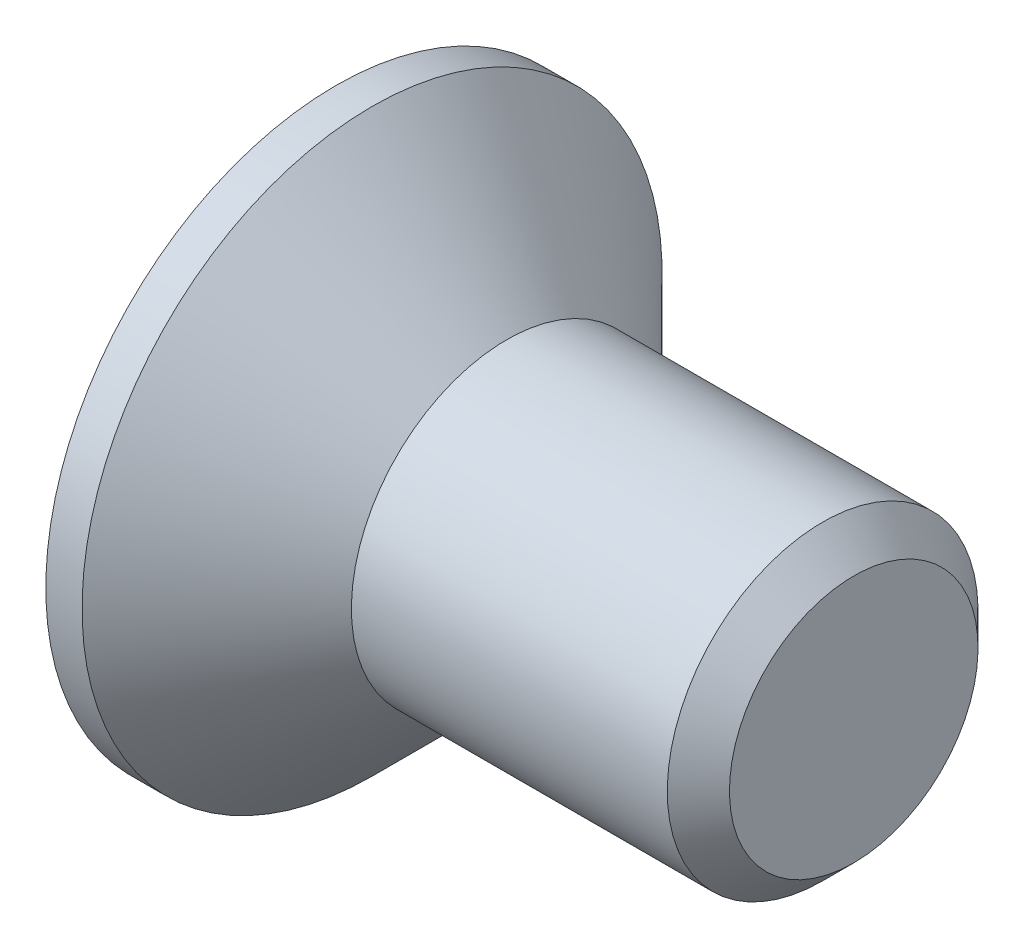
ISO-10303-21;
HEADER;
FILE_DESCRIPTION(('STEP AP214'),'2;1');
FILE_NAME('part.step','',(''),(''),'','','');
FILE_SCHEMA(('AUTOMOTIVE_DESIGN { 1 0 10303 214 1 1 1 1 }'));
ENDSEC;
DATA;
#1=APPLICATION_CONTEXT('core data for automotive mechanical design processes');
#2=APPLICATION_PROTOCOL_DEFINITION('international standard','automotive_design',2000,#1);
#3=PRODUCT_CONTEXT('',#1,'mechanical');
#4=PRODUCT('Part','Part','',(#3));
#5=PRODUCT_RELATED_PRODUCT_CATEGORY('part','',(#4));
#6=PRODUCT_DEFINITION_FORMATION('','',#4);
#7=PRODUCT_DEFINITION_CONTEXT('part definition',#1,'design');
#8=PRODUCT_DEFINITION('design','',#6,#7);
#9=PRODUCT_DEFINITION_SHAPE('','',#8);
#10=(LENGTH_UNIT() NAMED_UNIT(*) SI_UNIT(.MILLI.,.METRE.));
#11=(NAMED_UNIT(*) PLANE_ANGLE_UNIT() SI_UNIT($,.RADIAN.));
#12=(NAMED_UNIT(*) SI_UNIT($,.STERADIAN.) SOLID_ANGLE_UNIT());
#13=UNCERTAINTY_MEASURE_WITH_UNIT(LENGTH_MEASURE(1.E-05),#10,'distance_accuracy_value','');
#14=(GEOMETRIC_REPRESENTATION_CONTEXT(3) GLOBAL_UNCERTAINTY_ASSIGNED_CONTEXT((#13)) GLOBAL_UNIT_ASSIGNED_CONTEXT((#10,
#11,#12)) REPRESENTATION_CONTEXT('',''));
#15=CARTESIAN_POINT('',(0.,0.,0.));
#16=DIRECTION('',(0.,0.,1.));
#17=DIRECTION('',(1.,0.,0.));
#18=AXIS2_PLACEMENT_3D('',#15,#16,#17);
#19=CARTESIAN_POINT('',(0.,0.,0.));
#20=DIRECTION('',(-1.,0.,0.));
#21=DIRECTION('',(0.,-1.,0.));
#22=AXIS2_PLACEMENT_3D('',#19,#20,#21);
#23=CONICAL_SURFACE('',#22,1.5,0.78539816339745);
#24=CARTESIAN_POINT('',(-1.3,0.,0.));
#25=DIRECTION('',(-1.,0.,0.));
#26=DIRECTION('',(0.,-1.,0.));
#27=AXIS2_PLACEMENT_3D('',#24,#25,#26);
#28=CIRCLE('',#27,2.8);
#29=CARTESIAN_POINT('',(-1.3,-2.8,0.));
#30=VERTEX_POINT('',#29);
#31=EDGE_CURVE('E189',#30,#30,#28,.T.);
#32=ORIENTED_EDGE('',*,*,#31,.F.);
#33=EDGE_LOOP('',(#32));
#34=FACE_BOUND('',#33,.T.);
#35=CARTESIAN_POINT('',(0.,0.,0.));
#36=DIRECTION('',(-1.,0.,0.));
#37=DIRECTION('',(0.,-1.,0.));
#38=AXIS2_PLACEMENT_3D('',#35,#36,#37);
#39=CIRCLE('',#38,1.5);
#40=CARTESIAN_POINT('',(0.,-1.5,0.));
#41=VERTEX_POINT('',#40);
#42=EDGE_CURVE('E212',#41,#41,#39,.T.);
#43=ORIENTED_EDGE('',*,*,#42,.T.);
#44=EDGE_LOOP('',(#43));
#45=FACE_BOUND('',#44,.T.);
#46=ADVANCED_FACE('F33',(#34,#45),#23,.T.);
#47=CARTESIAN_POINT('',(-1.65,0.,0.));
#48=DIRECTION('',(-1.,0.,0.));
#49=DIRECTION('',(0.,-1.,0.));
#50=AXIS2_PLACEMENT_3D('',#47,#48,#49);
#51=CYLINDRICAL_SURFACE('',#50,1.5);
#52=CARTESIAN_POINT('',(3.05,0.,0.));
#53=DIRECTION('',(-1.,0.,0.));
#54=DIRECTION('',(0.,-1.,0.));
#55=AXIS2_PLACEMENT_3D('',#52,#53,#54);
#56=CIRCLE('',#55,1.5);
#57=CARTESIAN_POINT('',(3.05,-1.5,0.));
#58=VERTEX_POINT('',#57);
#59=EDGE_CURVE('E41',#58,#58,#56,.T.);
#60=ORIENTED_EDGE('',*,*,#59,.T.);
#61=EDGE_LOOP('',(#60));
#62=FACE_BOUND('',#61,.T.);
#63=ORIENTED_EDGE('',*,*,#42,.F.);
#64=EDGE_LOOP('',(#63));
#65=FACE_BOUND('',#64,.T.);
#66=ADVANCED_FACE('F217',(#62,#65),#51,.T.);
#67=CARTESIAN_POINT('',(3.35,0.,0.));
#68=DIRECTION('',(-1.,0.,0.));
#69=DIRECTION('',(0.,-1.,0.));
#70=AXIS2_PLACEMENT_3D('',#67,#68,#69);
#71=PLANE('',#70);
#72=CARTESIAN_POINT('',(3.35,0.,0.));
#73=DIRECTION('',(-1.,0.,0.));
#74=DIRECTION('',(0.,-1.,0.));
#75=AXIS2_PLACEMENT_3D('',#72,#73,#74);
#76=CIRCLE('',#75,1.2);
#77=CARTESIAN_POINT('',(3.35,-1.2,0.));
#78=VERTEX_POINT('',#77);
#79=EDGE_CURVE('E11',#78,#78,#76,.F.);
#80=ORIENTED_EDGE('',*,*,#79,.T.);
#81=EDGE_LOOP('',(#80));
#82=FACE_BOUND('',#81,.T.);
#83=ADVANCED_FACE('F239',(#82),#71,.F.);
#84=CARTESIAN_POINT('',(-1.65,2.8,0.));
#85=DIRECTION('',(1.,0.,0.));
#86=DIRECTION('',(0.,1.,0.));
#87=AXIS2_PLACEMENT_3D('',#84,#85,#86);
#88=PLANE('',#87);
#89=DIRECTION('',(0.,0.,-1.));
#90=VECTOR('',#89,1.);
#91=CARTESIAN_POINT('',(-1.65,0.365,-1.45));
#92=LINE('',#91,#90);
#93=CARTESIAN_POINT('',(-1.65,0.365,-0.365));
#94=VERTEX_POINT('',#93);
#95=CARTESIAN_POINT('',(-1.65,0.365,-1.45));
#96=VERTEX_POINT('',#95);
#97=EDGE_CURVE('E158',#94,#96,#92,.T.);
#98=ORIENTED_EDGE('',*,*,#97,.F.);
#99=DIRECTION('',(0.,-1.,0.));
#100=VECTOR('',#99,1.);
#101=CARTESIAN_POINT('',(-1.65,0.365,-0.365));
#102=LINE('',#101,#100);
#103=CARTESIAN_POINT('',(-1.65,1.45,-0.365));
#104=VERTEX_POINT('',#103);
#105=EDGE_CURVE('E48',#104,#94,#102,.T.);
#106=ORIENTED_EDGE('',*,*,#105,.F.);
#107=DIRECTION('',(0.,0.,-1.));
#108=VECTOR('',#107,1.);
#109=CARTESIAN_POINT('',(-1.65,1.45,-0.365));
#110=LINE('',#109,#108);
#111=CARTESIAN_POINT('',(-1.65,1.45,0.365));
#112=VERTEX_POINT('',#111);
#113=EDGE_CURVE('E185',#112,#104,#110,.T.);
#114=ORIENTED_EDGE('',*,*,#113,.F.);
#115=DIRECTION('',(0.,1.,0.));
#116=VECTOR('',#115,1.);
#117=CARTESIAN_POINT('',(-1.65,1.45,0.365));
#118=LINE('',#117,#116);
#119=CARTESIAN_POINT('',(-1.65,0.365,0.365));
#120=VERTEX_POINT('',#119);
#121=EDGE_CURVE('E183',#120,#112,#118,.T.);
#122=ORIENTED_EDGE('',*,*,#121,.F.);
#123=DIRECTION('',(0.,0.,-1.));
#124=VECTOR('',#123,1.);
#125=CARTESIAN_POINT('',(-1.65,0.365,0.365));
#126=LINE('',#125,#124);
#127=CARTESIAN_POINT('',(-1.65,0.365,1.45));
#128=VERTEX_POINT('',#127);
#129=EDGE_CURVE('E132',#128,#120,#126,.T.);
#130=ORIENTED_EDGE('',*,*,#129,.F.);
#131=DIRECTION('',(0.,1.,0.));
#132=VECTOR('',#131,1.);
#133=CARTESIAN_POINT('',(-1.65,0.365,1.45));
#134=LINE('',#133,#132);
#135=CARTESIAN_POINT('',(-1.65,-0.365,1.45));
#136=VERTEX_POINT('',#135);
#137=EDGE_CURVE('E179',#136,#128,#134,.T.);
#138=ORIENTED_EDGE('',*,*,#137,.F.);
#139=DIRECTION('',(0.,0.,1.));
#140=VECTOR('',#139,1.);
#141=CARTESIAN_POINT('',(-1.65,-0.365,1.45));
#142=LINE('',#141,#140);
#143=CARTESIAN_POINT('',(-1.65,-0.365,0.365));
#144=VERTEX_POINT('',#143);
#145=EDGE_CURVE('E176',#144,#136,#142,.T.);
#146=ORIENTED_EDGE('',*,*,#145,.F.);
#147=DIRECTION('',(0.,1.,0.));
#148=VECTOR('',#147,1.);
#149=CARTESIAN_POINT('',(-1.65,-0.365,0.365));
#150=LINE('',#149,#148);
#151=CARTESIAN_POINT('',(-1.65,-1.45,0.365));
#152=VERTEX_POINT('',#151);
#153=EDGE_CURVE('E173',#152,#144,#150,.T.);
#154=ORIENTED_EDGE('',*,*,#153,.F.);
#155=DIRECTION('',(0.,0.,1.));
#156=VECTOR('',#155,1.);
#157=CARTESIAN_POINT('',(-1.65,-1.45,0.365));
#158=LINE('',#157,#156);
#159=CARTESIAN_POINT('',(-1.65,-1.45,-0.365));
#160=VERTEX_POINT('',#159);
#161=EDGE_CURVE('E170',#160,#152,#158,.T.);
#162=ORIENTED_EDGE('',*,*,#161,.F.);
#163=DIRECTION('',(0.,-1.,0.));
#164=VECTOR('',#163,1.);
#165=CARTESIAN_POINT('',(-1.65,-1.45,-0.365));
#166=LINE('',#165,#164);
#167=CARTESIAN_POINT('',(-1.65,-0.365,-0.365));
#168=VERTEX_POINT('',#167);
#169=EDGE_CURVE('E167',#168,#160,#166,.T.);
#170=ORIENTED_EDGE('',*,*,#169,.F.);
#171=DIRECTION('',(0.,0.,1.));
#172=VECTOR('',#171,1.);
#173=CARTESIAN_POINT('',(-1.65,-0.365,-0.365));
#174=LINE('',#173,#172);
#175=CARTESIAN_POINT('',(-1.65,-0.365,-1.45));
#176=VERTEX_POINT('',#175);
#177=EDGE_CURVE('E164',#176,#168,#174,.T.);
#178=ORIENTED_EDGE('',*,*,#177,.F.);
#179=DIRECTION('',(0.,-1.,0.));
#180=VECTOR('',#179,1.);
#181=CARTESIAN_POINT('',(-1.65,-0.365,-1.45));
#182=LINE('',#181,#180);
#183=EDGE_CURVE('E161',#96,#176,#182,.T.);
#184=ORIENTED_EDGE('',*,*,#183,.F.);
#185=EDGE_LOOP('',(#98,#106,#114,#122,#130,#138,#146,#154,#162,#170,#178,#184));
#186=FACE_BOUND('',#185,.T.);
#187=CARTESIAN_POINT('',(-1.65,0.,0.));
#188=DIRECTION('',(-1.,0.,0.));
#189=DIRECTION('',(0.,-1.,0.));
#190=AXIS2_PLACEMENT_3D('',#187,#188,#189);
#191=CIRCLE('',#190,2.8);
#192=CARTESIAN_POINT('',(-1.65,-2.8,0.));
#193=VERTEX_POINT('',#192);
#194=EDGE_CURVE('E209',#193,#193,#191,.T.);
#195=ORIENTED_EDGE('',*,*,#194,.T.);
#196=EDGE_LOOP('',(#195));
#197=FACE_BOUND('',#196,.T.);
#198=ADVANCED_FACE('F230',(#186,#197),#88,.F.);
#199=CARTESIAN_POINT('',(-1.65,0.,0.));
#200=DIRECTION('',(-1.,0.,0.));
#201=DIRECTION('',(0.,-1.,0.));
#202=AXIS2_PLACEMENT_3D('',#199,#200,#201);
#203=CYLINDRICAL_SURFACE('',#202,2.8);
#204=ORIENTED_EDGE('',*,*,#194,.F.);
#205=EDGE_LOOP('',(#204));
#206=FACE_BOUND('',#205,.T.);
#207=ORIENTED_EDGE('',*,*,#31,.T.);
#208=EDGE_LOOP('',(#207));
#209=FACE_BOUND('',#208,.T.);
#210=ADVANCED_FACE('F222',(#206,#209),#203,.T.);
#211=CARTESIAN_POINT('',(3.05,0.,0.));
#212=DIRECTION('',(-1.,0.,0.));
#213=DIRECTION('',(0.,-1.,0.));
#214=AXIS2_PLACEMENT_3D('',#211,#212,#213);
#215=CONICAL_SURFACE('',#214,1.5,0.785398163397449);
#216=ORIENTED_EDGE('',*,*,#79,.F.);
#217=EDGE_LOOP('',(#216));
#218=FACE_BOUND('',#217,.T.);
#219=ORIENTED_EDGE('',*,*,#59,.F.);
#220=EDGE_LOOP('',(#219));
#221=FACE_BOUND('',#220,.T.);
#222=ADVANCED_FACE('F35',(#218,#221),#215,.T.);
#223=CARTESIAN_POINT('',(-0.4,0.365,-0.365));
#224=DIRECTION('',(0.,0.,-1.));
#225=DIRECTION('',(-1.,0.,0.));
#226=AXIS2_PLACEMENT_3D('',#223,#224,#225);
#227=PLANE('',#226);
#228=ORIENTED_EDGE('',*,*,#105,.T.);
#229=DIRECTION('',(-1.,0.,0.));
#230=VECTOR('',#229,1.);
#231=CARTESIAN_POINT('',(-0.4,0.365,-0.365));
#232=LINE('',#231,#230);
#233=CARTESIAN_POINT('',(-0.4,0.365,-0.365));
#234=VERTEX_POINT('',#233);
#235=EDGE_CURVE('E96',#234,#94,#232,.T.);
#236=ORIENTED_EDGE('',*,*,#235,.F.);
#237=DIRECTION('',(0.,-1.,0.));
#238=VECTOR('',#237,1.);
#239=CARTESIAN_POINT('',(-0.4,0.365,-0.365));
#240=LINE('',#239,#238);
#241=CARTESIAN_POINT('',(-0.4,1.45,-0.365));
#242=VERTEX_POINT('',#241);
#243=EDGE_CURVE('E187',#242,#234,#240,.T.);
#244=ORIENTED_EDGE('',*,*,#243,.F.);
#245=DIRECTION('',(-1.,0.,0.));
#246=VECTOR('',#245,1.);
#247=CARTESIAN_POINT('',(-0.4,1.45,-0.365));
#248=LINE('',#247,#246);
#249=EDGE_CURVE('E56',#242,#104,#248,.T.);
#250=ORIENTED_EDGE('',*,*,#249,.T.);
#251=EDGE_LOOP('',(#228,#236,#244,#250));
#252=FACE_BOUND('',#251,.T.);
#253=ADVANCED_FACE('F221',(#252),#227,.F.);
#254=CARTESIAN_POINT('',(-0.4,1.45,-0.365));
#255=DIRECTION('',(0.,1.,0.));
#256=DIRECTION('',(-1.,0.,0.));
#257=AXIS2_PLACEMENT_3D('',#254,#255,#256);
#258=PLANE('',#257);
#259=ORIENTED_EDGE('',*,*,#113,.T.);
#260=ORIENTED_EDGE('',*,*,#249,.F.);
#261=DIRECTION('',(0.,0.,-1.));
#262=VECTOR('',#261,1.);
#263=CARTESIAN_POINT('',(-0.4,1.45,-0.365));
#264=LINE('',#263,#262);
#265=CARTESIAN_POINT('',(-0.4,1.45,0.365));
#266=VERTEX_POINT('',#265);
#267=EDGE_CURVE('E144',#266,#242,#264,.T.);
#268=ORIENTED_EDGE('',*,*,#267,.F.);
#269=DIRECTION('',(-1.,0.,0.));
#270=VECTOR('',#269,1.);
#271=CARTESIAN_POINT('',(-0.4,1.45,0.365));
#272=LINE('',#271,#270);
#273=EDGE_CURVE('E136',#266,#112,#272,.T.);
#274=ORIENTED_EDGE('',*,*,#273,.T.);
#275=EDGE_LOOP('',(#259,#260,#268,#274));
#276=FACE_BOUND('',#275,.T.);
#277=ADVANCED_FACE('F228',(#276),#258,.F.);
#278=CARTESIAN_POINT('',(-0.4,1.45,0.365));
#279=DIRECTION('',(0.,0.,1.));
#280=DIRECTION('',(1.,0.,0.));
#281=AXIS2_PLACEMENT_3D('',#278,#279,#280);
#282=PLANE('',#281);
#283=ORIENTED_EDGE('',*,*,#121,.T.);
#284=ORIENTED_EDGE('',*,*,#273,.F.);
#285=DIRECTION('',(0.,1.,0.));
#286=VECTOR('',#285,1.);
#287=CARTESIAN_POINT('',(-0.4,1.45,0.365));
#288=LINE('',#287,#286);
#289=CARTESIAN_POINT('',(-0.4,0.365,0.365));
#290=VERTEX_POINT('',#289);
#291=EDGE_CURVE('E140',#290,#266,#288,.T.);
#292=ORIENTED_EDGE('',*,*,#291,.F.);
#293=DIRECTION('',(-1.,0.,0.));
#294=VECTOR('',#293,1.);
#295=CARTESIAN_POINT('',(-0.4,0.365,0.365));
#296=LINE('',#295,#294);
#297=EDGE_CURVE('E125',#290,#120,#296,.T.);
#298=ORIENTED_EDGE('',*,*,#297,.T.);
#299=EDGE_LOOP('',(#283,#284,#292,#298));
#300=FACE_BOUND('',#299,.T.);
#301=ADVANCED_FACE('F141',(#300),#282,.F.);
#302=CARTESIAN_POINT('',(-0.4,0.365,0.365));
#303=DIRECTION('',(0.,1.,0.));
#304=DIRECTION('',(-1.,0.,0.));
#305=AXIS2_PLACEMENT_3D('',#302,#303,#304);
#306=PLANE('',#305);
#307=ORIENTED_EDGE('',*,*,#129,.T.);
#308=ORIENTED_EDGE('',*,*,#297,.F.);
#309=DIRECTION('',(0.,0.,-1.));
#310=VECTOR('',#309,1.);
#311=CARTESIAN_POINT('',(-0.4,0.365,0.365));
#312=LINE('',#311,#310);
#313=CARTESIAN_POINT('',(-0.4,0.365,1.45));
#314=VERTEX_POINT('',#313);
#315=EDGE_CURVE('E129',#314,#290,#312,.T.);
#316=ORIENTED_EDGE('',*,*,#315,.F.);
#317=DIRECTION('',(-1.,0.,0.));
#318=VECTOR('',#317,1.);
#319=CARTESIAN_POINT('',(-0.4,0.365,1.45));
#320=LINE('',#319,#318);
#321=EDGE_CURVE('E137',#314,#128,#320,.T.);
#322=ORIENTED_EDGE('',*,*,#321,.T.);
#323=EDGE_LOOP('',(#307,#308,#316,#322));
#324=FACE_BOUND('',#323,.T.);
#325=ADVANCED_FACE('F127',(#324),#306,.F.);
#326=CARTESIAN_POINT('',(-0.4,0.365,1.45));
#327=DIRECTION('',(0.,0.,1.));
#328=DIRECTION('',(1.,0.,0.));
#329=AXIS2_PLACEMENT_3D('',#326,#327,#328);
#330=PLANE('',#329);
#331=ORIENTED_EDGE('',*,*,#137,.T.);
#332=ORIENTED_EDGE('',*,*,#321,.F.);
#333=DIRECTION('',(0.,1.,0.));
#334=VECTOR('',#333,1.);
#335=CARTESIAN_POINT('',(-0.4,0.365,1.45));
#336=LINE('',#335,#334);
#337=CARTESIAN_POINT('',(-0.4,-0.365,1.45));
#338=VERTEX_POINT('',#337);
#339=EDGE_CURVE('E150',#338,#314,#336,.T.);
#340=ORIENTED_EDGE('',*,*,#339,.F.);
#341=DIRECTION('',(-1.,0.,0.));
#342=VECTOR('',#341,1.);
#343=CARTESIAN_POINT('',(-0.4,-0.365,1.45));
#344=LINE('',#343,#342);
#345=EDGE_CURVE('E192',#338,#136,#344,.T.);
#346=ORIENTED_EDGE('',*,*,#345,.T.);
#347=EDGE_LOOP('',(#331,#332,#340,#346));
#348=FACE_BOUND('',#347,.T.);
#349=ADVANCED_FACE('F277',(#348),#330,.F.);
#350=CARTESIAN_POINT('',(-0.4,-0.365,1.45));
#351=DIRECTION('',(0.,-1.,0.));
#352=DIRECTION('',(1.,0.,0.));
#353=AXIS2_PLACEMENT_3D('',#350,#351,#352);
#354=PLANE('',#353);
#355=ORIENTED_EDGE('',*,*,#145,.T.);
#356=ORIENTED_EDGE('',*,*,#345,.F.);
#357=DIRECTION('',(0.,0.,1.));
#358=VECTOR('',#357,1.);
#359=CARTESIAN_POINT('',(-0.4,-0.365,1.45));
#360=LINE('',#359,#358);
#361=CARTESIAN_POINT('',(-0.4,-0.365,0.365));
#362=VERTEX_POINT('',#361);
#363=EDGE_CURVE('E152',#362,#338,#360,.T.);
#364=ORIENTED_EDGE('',*,*,#363,.F.);
#365=DIRECTION('',(-1.,0.,0.));
#366=VECTOR('',#365,1.);
#367=CARTESIAN_POINT('',(-0.4,-0.365,0.365));
#368=LINE('',#367,#366);
#369=EDGE_CURVE('E194',#362,#144,#368,.T.);
#370=ORIENTED_EDGE('',*,*,#369,.T.);
#371=EDGE_LOOP('',(#355,#356,#364,#370));
#372=FACE_BOUND('',#371,.T.);
#373=ADVANCED_FACE('F273',(#372),#354,.F.);
#374=CARTESIAN_POINT('',(-0.4,-0.365,0.365));
#375=DIRECTION('',(0.,0.,1.));
#376=DIRECTION('',(1.,0.,0.));
#377=AXIS2_PLACEMENT_3D('',#374,#375,#376);
#378=PLANE('',#377);
#379=ORIENTED_EDGE('',*,*,#153,.T.);
#380=ORIENTED_EDGE('',*,*,#369,.F.);
#381=DIRECTION('',(0.,1.,0.));
#382=VECTOR('',#381,1.);
#383=CARTESIAN_POINT('',(-0.4,-0.365,0.365));
#384=LINE('',#383,#382);
#385=CARTESIAN_POINT('',(-0.4,-1.45,0.365));
#386=VERTEX_POINT('',#385);
#387=EDGE_CURVE('E422',#386,#362,#384,.T.);
#388=ORIENTED_EDGE('',*,*,#387,.F.);
#389=DIRECTION('',(-1.,0.,0.));
#390=VECTOR('',#389,1.);
#391=CARTESIAN_POINT('',(-0.4,-1.45,0.365));
#392=LINE('',#391,#390);
#393=EDGE_CURVE('E196',#386,#152,#392,.T.);
#394=ORIENTED_EDGE('',*,*,#393,.T.);
#395=EDGE_LOOP('',(#379,#380,#388,#394));
#396=FACE_BOUND('',#395,.T.);
#397=ADVANCED_FACE('F269',(#396),#378,.F.);
#398=CARTESIAN_POINT('',(-0.4,-1.45,0.365));
#399=DIRECTION('',(0.,-1.,0.));
#400=DIRECTION('',(1.,0.,0.));
#401=AXIS2_PLACEMENT_3D('',#398,#399,#400);
#402=PLANE('',#401);
#403=ORIENTED_EDGE('',*,*,#161,.T.);
#404=ORIENTED_EDGE('',*,*,#393,.F.);
#405=DIRECTION('',(0.,0.,1.));
#406=VECTOR('',#405,1.);
#407=CARTESIAN_POINT('',(-0.4,-1.45,0.365));
#408=LINE('',#407,#406);
#409=CARTESIAN_POINT('',(-0.4,-1.45,-0.365));
#410=VERTEX_POINT('',#409);
#411=EDGE_CURVE('E419',#410,#386,#408,.T.);
#412=ORIENTED_EDGE('',*,*,#411,.F.);
#413=DIRECTION('',(-1.,0.,0.));
#414=VECTOR('',#413,1.);
#415=CARTESIAN_POINT('',(-0.4,-1.45,-0.365));
#416=LINE('',#415,#414);
#417=EDGE_CURVE('E198',#410,#160,#416,.T.);
#418=ORIENTED_EDGE('',*,*,#417,.T.);
#419=EDGE_LOOP('',(#403,#404,#412,#418));
#420=FACE_BOUND('',#419,.T.);
#421=ADVANCED_FACE('F265',(#420),#402,.F.);
#422=CARTESIAN_POINT('',(-0.4,-1.45,-0.365));
#423=DIRECTION('',(0.,0.,-1.));
#424=DIRECTION('',(-1.,0.,0.));
#425=AXIS2_PLACEMENT_3D('',#422,#423,#424);
#426=PLANE('',#425);
#427=ORIENTED_EDGE('',*,*,#169,.T.);
#428=ORIENTED_EDGE('',*,*,#417,.F.);
#429=DIRECTION('',(0.,-1.,0.));
#430=VECTOR('',#429,1.);
#431=CARTESIAN_POINT('',(-0.4,-1.45,-0.365));
#432=LINE('',#431,#430);
#433=CARTESIAN_POINT('',(-0.4,-0.365,-0.365));
#434=VERTEX_POINT('',#433);
#435=EDGE_CURVE('E416',#434,#410,#432,.T.);
#436=ORIENTED_EDGE('',*,*,#435,.F.);
#437=DIRECTION('',(-1.,0.,0.));
#438=VECTOR('',#437,1.);
#439=CARTESIAN_POINT('',(-0.4,-0.365,-0.365));
#440=LINE('',#439,#438);
#441=EDGE_CURVE('E200',#434,#168,#440,.T.);
#442=ORIENTED_EDGE('',*,*,#441,.T.);
#443=EDGE_LOOP('',(#427,#428,#436,#442));
#444=FACE_BOUND('',#443,.T.);
#445=ADVANCED_FACE('F261',(#444),#426,.F.);
#446=CARTESIAN_POINT('',(-0.4,-0.365,-0.365));
#447=DIRECTION('',(0.,-1.,0.));
#448=DIRECTION('',(1.,0.,0.));
#449=AXIS2_PLACEMENT_3D('',#446,#447,#448);
#450=PLANE('',#449);
#451=ORIENTED_EDGE('',*,*,#177,.T.);
#452=ORIENTED_EDGE('',*,*,#441,.F.);
#453=DIRECTION('',(0.,0.,1.));
#454=VECTOR('',#453,1.);
#455=CARTESIAN_POINT('',(-0.4,-0.365,-0.365));
#456=LINE('',#455,#454);
#457=CARTESIAN_POINT('',(-0.4,-0.365,-1.45));
#458=VERTEX_POINT('',#457);
#459=EDGE_CURVE('E413',#458,#434,#456,.T.);
#460=ORIENTED_EDGE('',*,*,#459,.F.);
#461=DIRECTION('',(-1.,0.,0.));
#462=VECTOR('',#461,1.);
#463=CARTESIAN_POINT('',(-0.4,-0.365,-1.45));
#464=LINE('',#463,#462);
#465=EDGE_CURVE('E202',#458,#176,#464,.T.);
#466=ORIENTED_EDGE('',*,*,#465,.T.);
#467=EDGE_LOOP('',(#451,#452,#460,#466));
#468=FACE_BOUND('',#467,.T.);
#469=ADVANCED_FACE('F257',(#468),#450,.F.);
#470=CARTESIAN_POINT('',(-0.4,-0.365,-1.45));
#471=DIRECTION('',(0.,0.,-1.));
#472=DIRECTION('',(-1.,0.,0.));
#473=AXIS2_PLACEMENT_3D('',#470,#471,#472);
#474=PLANE('',#473);
#475=ORIENTED_EDGE('',*,*,#183,.T.);
#476=ORIENTED_EDGE('',*,*,#465,.F.);
#477=DIRECTION('',(0.,-1.,0.));
#478=VECTOR('',#477,1.);
#479=CARTESIAN_POINT('',(-0.4,-0.365,-1.45));
#480=LINE('',#479,#478);
#481=CARTESIAN_POINT('',(-0.4,0.365,-1.45));
#482=VERTEX_POINT('',#481);
#483=EDGE_CURVE('E408',#482,#458,#480,.T.);
#484=ORIENTED_EDGE('',*,*,#483,.F.);
#485=DIRECTION('',(-1.,0.,0.));
#486=VECTOR('',#485,1.);
#487=CARTESIAN_POINT('',(-0.4,0.365,-1.45));
#488=LINE('',#487,#486);
#489=EDGE_CURVE('E204',#482,#96,#488,.T.);
#490=ORIENTED_EDGE('',*,*,#489,.T.);
#491=EDGE_LOOP('',(#475,#476,#484,#490));
#492=FACE_BOUND('',#491,.T.);
#493=ADVANCED_FACE('F253',(#492),#474,.F.);
#494=CARTESIAN_POINT('',(-0.4,0.365,-1.45));
#495=DIRECTION('',(0.,1.,0.));
#496=DIRECTION('',(-1.,0.,0.));
#497=AXIS2_PLACEMENT_3D('',#494,#495,#496);
#498=PLANE('',#497);
#499=ORIENTED_EDGE('',*,*,#97,.T.);
#500=ORIENTED_EDGE('',*,*,#489,.F.);
#501=DIRECTION('',(0.,0.,-1.));
#502=VECTOR('',#501,1.);
#503=CARTESIAN_POINT('',(-0.4,0.365,-1.45));
#504=LINE('',#503,#502);
#505=EDGE_CURVE('E406',#234,#482,#504,.T.);
#506=ORIENTED_EDGE('',*,*,#505,.F.);
#507=ORIENTED_EDGE('',*,*,#235,.T.);
#508=EDGE_LOOP('',(#499,#500,#506,#507));
#509=FACE_BOUND('',#508,.T.);
#510=ADVANCED_FACE('F250',(#509),#498,.F.);
#511=CARTESIAN_POINT('',(-0.4,0.,0.));
#512=DIRECTION('',(1.,0.,0.));
#513=DIRECTION('',(0.,0.,-1.));
#514=AXIS2_PLACEMENT_3D('',#511,#512,#513);
#515=PLANE('',#514);
#516=ORIENTED_EDGE('',*,*,#243,.T.);
#517=ORIENTED_EDGE('',*,*,#505,.T.);
#518=ORIENTED_EDGE('',*,*,#483,.T.);
#519=ORIENTED_EDGE('',*,*,#459,.T.);
#520=ORIENTED_EDGE('',*,*,#435,.T.);
#521=ORIENTED_EDGE('',*,*,#411,.T.);
#522=ORIENTED_EDGE('',*,*,#387,.T.);
#523=ORIENTED_EDGE('',*,*,#363,.T.);
#524=ORIENTED_EDGE('',*,*,#339,.T.);
#525=ORIENTED_EDGE('',*,*,#315,.T.);
#526=ORIENTED_EDGE('',*,*,#291,.T.);
#527=ORIENTED_EDGE('',*,*,#267,.T.);
#528=EDGE_LOOP('',(#516,#517,#518,#519,#520,#521,#522,#523,#524,#525,#526,#527));
#529=FACE_BOUND('',#528,.T.);
#530=ADVANCED_FACE('F147',(#529),#515,.F.);
#531=CLOSED_SHELL('',(#46,#66,#83,#198,#210,#222,#253,#277,#301,#325,#349,#373,#397,#421,#445,
#469,#493,#510,#530));
#532=MANIFOLD_SOLID_BREP('B2',#531);
#533=ADVANCED_BREP_SHAPE_REPRESENTATION('',(#18,#532),#14);
#534=SHAPE_DEFINITION_REPRESENTATION(#9,#533);
ENDSEC;
END-ISO-10303-21;
